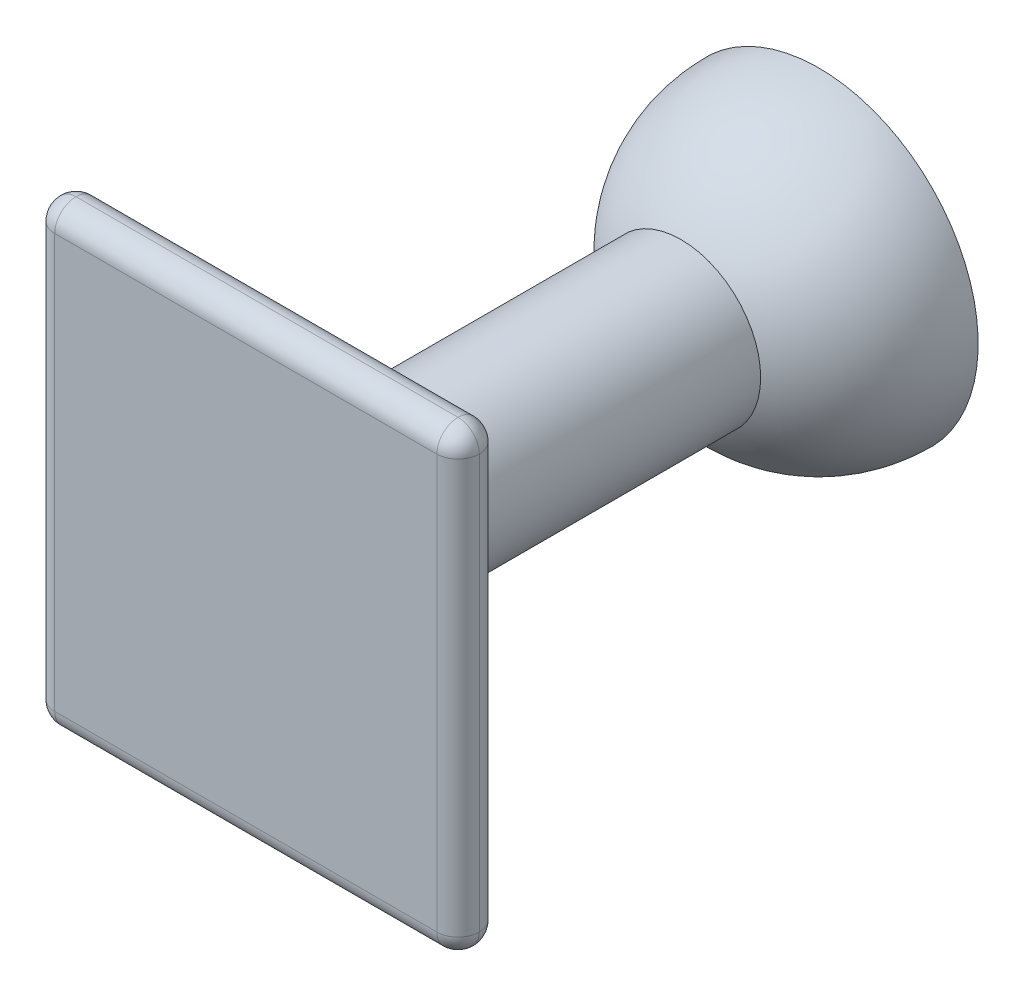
ISO-10303-21;
HEADER;
FILE_DESCRIPTION(('STEP AP214'),'2;1');
FILE_NAME('part.step','',(''),(''),'','','');
FILE_SCHEMA(('AUTOMOTIVE_DESIGN { 1 0 10303 214 1 1 1 1 }'));
ENDSEC;
DATA;
#1=APPLICATION_CONTEXT('core data for automotive mechanical design processes');
#2=APPLICATION_PROTOCOL_DEFINITION('international standard','automotive_design',2000,#1);
#3=PRODUCT_CONTEXT('',#1,'mechanical');
#4=PRODUCT('Part','Part','',(#3));
#5=PRODUCT_RELATED_PRODUCT_CATEGORY('part','',(#4));
#6=PRODUCT_DEFINITION_FORMATION('','',#4);
#7=PRODUCT_DEFINITION_CONTEXT('part definition',#1,'design');
#8=PRODUCT_DEFINITION('design','',#6,#7);
#9=PRODUCT_DEFINITION_SHAPE('','',#8);
#10=(LENGTH_UNIT() NAMED_UNIT(*) SI_UNIT(.MILLI.,.METRE.));
#11=(NAMED_UNIT(*) PLANE_ANGLE_UNIT() SI_UNIT($,.RADIAN.));
#12=(NAMED_UNIT(*) SI_UNIT($,.STERADIAN.) SOLID_ANGLE_UNIT());
#13=UNCERTAINTY_MEASURE_WITH_UNIT(LENGTH_MEASURE(1.E-05),#10,'distance_accuracy_value','');
#14=(GEOMETRIC_REPRESENTATION_CONTEXT(3) GLOBAL_UNCERTAINTY_ASSIGNED_CONTEXT((#13)) GLOBAL_UNIT_ASSIGNED_CONTEXT((#10,
#11,#12)) REPRESENTATION_CONTEXT('',''));
#15=CARTESIAN_POINT('',(0.,0.,0.));
#16=DIRECTION('',(0.,0.,1.));
#17=DIRECTION('',(1.,0.,0.));
#18=AXIS2_PLACEMENT_3D('',#15,#16,#17);
#19=CARTESIAN_POINT('',(-20.,21.5,4.));
#20=DIRECTION('',(0.,0.,-1.));
#21=DIRECTION('',(-1.,0.,0.));
#22=AXIS2_PLACEMENT_3D('',#19,#20,#21);
#23=PLANE('',#22);
#24=DIRECTION('',(0.,-1.,0.));
#25=VECTOR('',#24,1.);
#26=CARTESIAN_POINT('',(18.,21.5,4.));
#27=LINE('',#26,#25);
#28=CARTESIAN_POINT('',(18.,-19.5,4.));
#29=VERTEX_POINT('',#28);
#30=CARTESIAN_POINT('',(18.,19.5,4.));
#31=VERTEX_POINT('',#30);
#32=EDGE_CURVE('E138',#29,#31,#27,.F.);
#33=ORIENTED_EDGE('',*,*,#32,.T.);
#34=DIRECTION('',(1.,0.,0.));
#35=VECTOR('',#34,1.);
#36=CARTESIAN_POINT('',(-20.,19.5,4.));
#37=LINE('',#36,#35);
#38=CARTESIAN_POINT('',(-18.,19.5,4.));
#39=VERTEX_POINT('',#38);
#40=EDGE_CURVE('E198',#31,#39,#37,.F.);
#41=ORIENTED_EDGE('',*,*,#40,.T.);
#42=DIRECTION('',(0.,-1.,0.));
#43=VECTOR('',#42,1.);
#44=CARTESIAN_POINT('',(-18.,-21.5,4.));
#45=LINE('',#44,#43);
#46=CARTESIAN_POINT('',(-18.,-19.5,4.));
#47=VERTEX_POINT('',#46);
#48=EDGE_CURVE('E195',#39,#47,#45,.T.);
#49=ORIENTED_EDGE('',*,*,#48,.T.);
#50=DIRECTION('',(1.,0.,0.));
#51=VECTOR('',#50,1.);
#52=CARTESIAN_POINT('',(20.,-19.5,4.));
#53=LINE('',#52,#51);
#54=EDGE_CURVE('E193',#47,#29,#53,.T.);
#55=ORIENTED_EDGE('',*,*,#54,.T.);
#56=EDGE_LOOP('',(#33,#41,#49,#55));
#57=FACE_BOUND('',#56,.T.);
#58=ADVANCED_FACE('F41',(#57),#23,.F.);
#59=CARTESIAN_POINT('',(-20.,21.5,0.));
#60=DIRECTION('',(0.,0.,-1.));
#61=DIRECTION('',(-1.,0.,0.));
#62=AXIS2_PLACEMENT_3D('',#59,#60,#61);
#63=PLANE('',#62);
#64=CARTESIAN_POINT('',(0.,0.,0.));
#65=DIRECTION('',(0.,0.,-1.));
#66=DIRECTION('',(-1.,0.,0.));
#67=AXIS2_PLACEMENT_3D('',#64,#65,#66);
#68=CIRCLE('',#67,7.5);
#69=CARTESIAN_POINT('',(7.5,0.,0.));
#70=VERTEX_POINT('',#69);
#71=EDGE_CURVE('E12',#70,#70,#68,.T.);
#72=ORIENTED_EDGE('',*,*,#71,.F.);
#73=EDGE_LOOP('',(#72));
#74=FACE_BOUND('',#73,.T.);
#75=DIRECTION('',(0.,-1.,0.));
#76=VECTOR('',#75,1.);
#77=CARTESIAN_POINT('',(-18.,21.5,0.));
#78=LINE('',#77,#76);
#79=CARTESIAN_POINT('',(-18.,-19.5,0.));
#80=VERTEX_POINT('',#79);
#81=CARTESIAN_POINT('',(-18.,19.5,0.));
#82=VERTEX_POINT('',#81);
#83=EDGE_CURVE('E59',#80,#82,#78,.F.);
#84=ORIENTED_EDGE('',*,*,#83,.T.);
#85=DIRECTION('',(1.,0.,0.));
#86=VECTOR('',#85,1.);
#87=CARTESIAN_POINT('',(20.,19.5,0.));
#88=LINE('',#87,#86);
#89=CARTESIAN_POINT('',(18.,19.5,0.));
#90=VERTEX_POINT('',#89);
#91=EDGE_CURVE('E48',#82,#90,#88,.T.);
#92=ORIENTED_EDGE('',*,*,#91,.T.);
#93=DIRECTION('',(0.,-1.,0.));
#94=VECTOR('',#93,1.);
#95=CARTESIAN_POINT('',(18.,21.5,0.));
#96=LINE('',#95,#94);
#97=CARTESIAN_POINT('',(18.,-19.5,0.));
#98=VERTEX_POINT('',#97);
#99=EDGE_CURVE('E203',#90,#98,#96,.T.);
#100=ORIENTED_EDGE('',*,*,#99,.T.);
#101=DIRECTION('',(1.,0.,0.));
#102=VECTOR('',#101,1.);
#103=CARTESIAN_POINT('',(-20.,-19.5,0.));
#104=LINE('',#103,#102);
#105=EDGE_CURVE('E200',#98,#80,#104,.F.);
#106=ORIENTED_EDGE('',*,*,#105,.T.);
#107=EDGE_LOOP('',(#84,#92,#100,#106));
#108=FACE_BOUND('',#107,.T.);
#109=ADVANCED_FACE('F204',(#74,#108),#63,.T.);
#110=CARTESIAN_POINT('',(-18.,21.5,2.));
#111=DIRECTION('',(0.,-1.,0.));
#112=DIRECTION('',(0.,0.,-1.));
#113=AXIS2_PLACEMENT_3D('',#110,#111,#112);
#114=CYLINDRICAL_SURFACE('',#113,2.);
#115=DIRECTION('',(0.,-1.,0.));
#116=VECTOR('',#115,1.);
#117=CARTESIAN_POINT('',(-20.,21.5,2.));
#118=LINE('',#117,#116);
#119=CARTESIAN_POINT('',(-20.,19.5,2.));
#120=VERTEX_POINT('',#119);
#121=CARTESIAN_POINT('',(-20.,-19.5,2.));
#122=VERTEX_POINT('',#121);
#123=EDGE_CURVE('E181',#120,#122,#118,.T.);
#124=ORIENTED_EDGE('',*,*,#123,.F.);
#125=CARTESIAN_POINT('',(-18.,19.5,2.));
#126=DIRECTION('',(0.,1.,0.));
#127=DIRECTION('',(0.,0.,1.));
#128=AXIS2_PLACEMENT_3D('',#125,#126,#127);
#129=CIRCLE('',#128,2.);
#130=EDGE_CURVE('E190',#82,#120,#129,.T.);
#131=ORIENTED_EDGE('',*,*,#130,.F.);
#132=ORIENTED_EDGE('',*,*,#83,.F.);
#133=CARTESIAN_POINT('',(-18.,-19.5,2.));
#134=DIRECTION('',(0.,-1.,0.));
#135=DIRECTION('',(0.,0.,-1.));
#136=AXIS2_PLACEMENT_3D('',#133,#134,#135);
#137=CIRCLE('',#136,2.);
#138=EDGE_CURVE('E187',#122,#80,#137,.T.);
#139=ORIENTED_EDGE('',*,*,#138,.F.);
#140=EDGE_LOOP('',(#124,#131,#132,#139));
#141=FACE_BOUND('',#140,.T.);
#142=ADVANCED_FACE('F208',(#141),#114,.T.);
#143=CARTESIAN_POINT('',(-18.,19.5,2.));
#144=DIRECTION('',(0.,0.,1.));
#145=DIRECTION('',(1.,0.,0.));
#146=AXIS2_PLACEMENT_3D('',#143,#144,#145);
#147=SPHERICAL_SURFACE('',#146,2.);
#148=ORIENTED_EDGE('',*,*,#130,.T.);
#149=CARTESIAN_POINT('',(-18.,19.5,2.));
#150=DIRECTION('',(0.,0.,1.));
#151=DIRECTION('',(1.,0.,0.));
#152=AXIS2_PLACEMENT_3D('',#149,#150,#151);
#153=CIRCLE('',#152,2.);
#154=CARTESIAN_POINT('',(-18.,21.5,2.));
#155=VERTEX_POINT('',#154);
#156=EDGE_CURVE('E176',#155,#120,#153,.T.);
#157=ORIENTED_EDGE('',*,*,#156,.F.);
#158=CARTESIAN_POINT('',(-18.,19.5,2.));
#159=DIRECTION('',(-1.,0.,0.));
#160=DIRECTION('',(0.,0.,1.));
#161=AXIS2_PLACEMENT_3D('',#158,#159,#160);
#162=CIRCLE('',#161,2.);
#163=EDGE_CURVE('E173',#82,#155,#162,.F.);
#164=ORIENTED_EDGE('',*,*,#163,.F.);
#165=EDGE_LOOP('',(#148,#157,#164));
#166=FACE_BOUND('',#165,.T.);
#167=ADVANCED_FACE('F227',(#166),#147,.T.);
#168=CARTESIAN_POINT('',(-18.,-19.5,2.));
#169=DIRECTION('',(0.,0.,1.));
#170=DIRECTION('',(1.,0.,0.));
#171=AXIS2_PLACEMENT_3D('',#168,#169,#170);
#172=SPHERICAL_SURFACE('',#171,2.);
#173=CARTESIAN_POINT('',(-18.,-19.5,2.));
#174=DIRECTION('',(0.,0.,-1.));
#175=DIRECTION('',(-1.,0.,0.));
#176=AXIS2_PLACEMENT_3D('',#173,#174,#175);
#177=CIRCLE('',#176,2.);
#178=CARTESIAN_POINT('',(-18.,-21.5,2.));
#179=VERTEX_POINT('',#178);
#180=EDGE_CURVE('E184',#122,#179,#177,.F.);
#181=ORIENTED_EDGE('',*,*,#180,.F.);
#182=ORIENTED_EDGE('',*,*,#138,.T.);
#183=CARTESIAN_POINT('',(-18.,-19.5,2.));
#184=DIRECTION('',(-1.,0.,0.));
#185=DIRECTION('',(0.,-1.,0.));
#186=AXIS2_PLACEMENT_3D('',#183,#184,#185);
#187=CIRCLE('',#186,2.);
#188=EDGE_CURVE('E170',#179,#80,#187,.F.);
#189=ORIENTED_EDGE('',*,*,#188,.F.);
#190=EDGE_LOOP('',(#181,#182,#189));
#191=FACE_BOUND('',#190,.T.);
#192=ADVANCED_FACE('F212',(#191),#172,.T.);
#193=CARTESIAN_POINT('',(-18.,21.5,2.));
#194=DIRECTION('',(0.,1.,0.));
#195=DIRECTION('',(0.,0.,1.));
#196=AXIS2_PLACEMENT_3D('',#193,#194,#195);
#197=CYLINDRICAL_SURFACE('',#196,2.);
#198=CARTESIAN_POINT('',(-18.,19.5,2.));
#199=DIRECTION('',(0.,1.,0.));
#200=DIRECTION('',(0.,0.,1.));
#201=AXIS2_PLACEMENT_3D('',#198,#199,#200);
#202=CIRCLE('',#201,2.);
#203=EDGE_CURVE('E178',#120,#39,#202,.T.);
#204=ORIENTED_EDGE('',*,*,#203,.F.);
#205=ORIENTED_EDGE('',*,*,#123,.T.);
#206=CARTESIAN_POINT('',(-18.,-19.5,2.));
#207=DIRECTION('',(0.,-1.,0.));
#208=DIRECTION('',(1.,0.,0.));
#209=AXIS2_PLACEMENT_3D('',#206,#207,#208);
#210=CIRCLE('',#209,2.);
#211=EDGE_CURVE('E167',#47,#122,#210,.T.);
#212=ORIENTED_EDGE('',*,*,#211,.F.);
#213=ORIENTED_EDGE('',*,*,#48,.F.);
#214=EDGE_LOOP('',(#204,#205,#212,#213));
#215=FACE_BOUND('',#214,.T.);
#216=ADVANCED_FACE('F225',(#215),#197,.T.);
#217=CARTESIAN_POINT('',(-18.,19.5,2.));
#218=DIRECTION('',(0.,0.,1.));
#219=DIRECTION('',(1.,0.,0.));
#220=AXIS2_PLACEMENT_3D('',#217,#218,#219);
#221=SPHERICAL_SURFACE('',#220,2.);
#222=ORIENTED_EDGE('',*,*,#156,.T.);
#223=ORIENTED_EDGE('',*,*,#203,.T.);
#224=CARTESIAN_POINT('',(-18.,19.5,2.));
#225=DIRECTION('',(-1.,0.,0.));
#226=DIRECTION('',(0.,0.,1.));
#227=AXIS2_PLACEMENT_3D('',#224,#225,#226);
#228=CIRCLE('',#227,2.);
#229=EDGE_CURVE('E164',#155,#39,#228,.F.);
#230=ORIENTED_EDGE('',*,*,#229,.F.);
#231=EDGE_LOOP('',(#222,#223,#230));
#232=FACE_BOUND('',#231,.T.);
#233=ADVANCED_FACE('F257',(#232),#221,.T.);
#234=CARTESIAN_POINT('',(-20.,19.5,2.));
#235=DIRECTION('',(-1.,0.,0.));
#236=DIRECTION('',(0.,0.,1.));
#237=AXIS2_PLACEMENT_3D('',#234,#235,#236);
#238=CYLINDRICAL_SURFACE('',#237,2.);
#239=ORIENTED_EDGE('',*,*,#91,.F.);
#240=ORIENTED_EDGE('',*,*,#163,.T.);
#241=DIRECTION('',(1.,0.,0.));
#242=VECTOR('',#241,1.);
#243=CARTESIAN_POINT('',(-20.,21.5,2.));
#244=LINE('',#243,#242);
#245=CARTESIAN_POINT('',(18.,21.5,2.));
#246=VERTEX_POINT('',#245);
#247=EDGE_CURVE('E161',#246,#155,#244,.F.);
#248=ORIENTED_EDGE('',*,*,#247,.F.);
#249=CARTESIAN_POINT('',(18.,19.5,2.));
#250=DIRECTION('',(1.,0.,0.));
#251=DIRECTION('',(0.,1.,0.));
#252=AXIS2_PLACEMENT_3D('',#249,#250,#251);
#253=CIRCLE('',#252,2.);
#254=EDGE_CURVE('E158',#90,#246,#253,.T.);
#255=ORIENTED_EDGE('',*,*,#254,.F.);
#256=EDGE_LOOP('',(#239,#240,#248,#255));
#257=FACE_BOUND('',#256,.T.);
#258=ADVANCED_FACE('F230',(#257),#238,.T.);
#259=CARTESIAN_POINT('',(20.,-19.5,2.));
#260=DIRECTION('',(1.,0.,0.));
#261=DIRECTION('',(0.,0.,-1.));
#262=AXIS2_PLACEMENT_3D('',#259,#260,#261);
#263=CYLINDRICAL_SURFACE('',#262,2.);
#264=ORIENTED_EDGE('',*,*,#188,.T.);
#265=ORIENTED_EDGE('',*,*,#105,.F.);
#266=CARTESIAN_POINT('',(18.,-19.5,2.));
#267=DIRECTION('',(1.,0.,0.));
#268=DIRECTION('',(0.,0.,-1.));
#269=AXIS2_PLACEMENT_3D('',#266,#267,#268);
#270=CIRCLE('',#269,2.);
#271=CARTESIAN_POINT('',(18.,-21.5,2.));
#272=VERTEX_POINT('',#271);
#273=EDGE_CURVE('E109',#272,#98,#270,.T.);
#274=ORIENTED_EDGE('',*,*,#273,.F.);
#275=DIRECTION('',(1.,0.,0.));
#276=VECTOR('',#275,1.);
#277=CARTESIAN_POINT('',(20.,-21.5,2.));
#278=LINE('',#277,#276);
#279=EDGE_CURVE('E124',#179,#272,#278,.T.);
#280=ORIENTED_EDGE('',*,*,#279,.F.);
#281=EDGE_LOOP('',(#264,#265,#274,#280));
#282=FACE_BOUND('',#281,.T.);
#283=ADVANCED_FACE('F214',(#282),#263,.T.);
#284=CARTESIAN_POINT('',(-18.,-19.5,2.));
#285=DIRECTION('',(0.,0.,1.));
#286=DIRECTION('',(1.,0.,0.));
#287=AXIS2_PLACEMENT_3D('',#284,#285,#286);
#288=SPHERICAL_SURFACE('',#287,2.);
#289=ORIENTED_EDGE('',*,*,#211,.T.);
#290=ORIENTED_EDGE('',*,*,#180,.T.);
#291=CARTESIAN_POINT('',(-18.,-19.5,2.));
#292=DIRECTION('',(-1.,0.,0.));
#293=DIRECTION('',(0.,0.,1.));
#294=AXIS2_PLACEMENT_3D('',#291,#292,#293);
#295=CIRCLE('',#294,2.);
#296=EDGE_CURVE('E153',#47,#179,#295,.F.);
#297=ORIENTED_EDGE('',*,*,#296,.F.);
#298=EDGE_LOOP('',(#289,#290,#297));
#299=FACE_BOUND('',#298,.T.);
#300=ADVANCED_FACE('F220',(#299),#288,.T.);
#301=CARTESIAN_POINT('',(20.,19.5,2.));
#302=DIRECTION('',(1.,0.,0.));
#303=DIRECTION('',(0.,0.,-1.));
#304=AXIS2_PLACEMENT_3D('',#301,#302,#303);
#305=CYLINDRICAL_SURFACE('',#304,2.);
#306=CARTESIAN_POINT('',(18.,19.5,2.));
#307=DIRECTION('',(1.,0.,0.));
#308=DIRECTION('',(0.,0.,-1.));
#309=AXIS2_PLACEMENT_3D('',#306,#307,#308);
#310=CIRCLE('',#309,2.);
#311=EDGE_CURVE('E150',#246,#31,#310,.T.);
#312=ORIENTED_EDGE('',*,*,#311,.F.);
#313=ORIENTED_EDGE('',*,*,#247,.T.);
#314=ORIENTED_EDGE('',*,*,#229,.T.);
#315=ORIENTED_EDGE('',*,*,#40,.F.);
#316=EDGE_LOOP('',(#312,#313,#314,#315));
#317=FACE_BOUND('',#316,.T.);
#318=ADVANCED_FACE('F238',(#317),#305,.T.);
#319=CARTESIAN_POINT('',(18.,19.5,2.));
#320=DIRECTION('',(0.,0.,1.));
#321=DIRECTION('',(1.,0.,0.));
#322=AXIS2_PLACEMENT_3D('',#319,#320,#321);
#323=SPHERICAL_SURFACE('',#322,2.);
#324=ORIENTED_EDGE('',*,*,#254,.T.);
#325=CARTESIAN_POINT('',(18.,19.5,2.));
#326=DIRECTION('',(0.,0.,1.));
#327=DIRECTION('',(1.,0.,0.));
#328=AXIS2_PLACEMENT_3D('',#325,#326,#327);
#329=CIRCLE('',#328,2.);
#330=CARTESIAN_POINT('',(20.,19.5,2.));
#331=VERTEX_POINT('',#330);
#332=EDGE_CURVE('E147',#331,#246,#329,.T.);
#333=ORIENTED_EDGE('',*,*,#332,.F.);
#334=CARTESIAN_POINT('',(18.,19.5,2.));
#335=DIRECTION('',(0.,1.,0.));
#336=DIRECTION('',(0.,0.,1.));
#337=AXIS2_PLACEMENT_3D('',#334,#335,#336);
#338=CIRCLE('',#337,2.);
#339=EDGE_CURVE('E114',#90,#331,#338,.F.);
#340=ORIENTED_EDGE('',*,*,#339,.F.);
#341=EDGE_LOOP('',(#324,#333,#340));
#342=FACE_BOUND('',#341,.T.);
#343=ADVANCED_FACE('F232',(#342),#323,.T.);
#344=CARTESIAN_POINT('',(18.,-19.5,2.));
#345=DIRECTION('',(0.,0.,1.));
#346=DIRECTION('',(1.,0.,0.));
#347=AXIS2_PLACEMENT_3D('',#344,#345,#346);
#348=SPHERICAL_SURFACE('',#347,2.);
#349=CARTESIAN_POINT('',(18.,-19.5,2.));
#350=DIRECTION('',(0.,0.,-1.));
#351=DIRECTION('',(-1.,0.,0.));
#352=AXIS2_PLACEMENT_3D('',#349,#350,#351);
#353=CIRCLE('',#352,2.);
#354=CARTESIAN_POINT('',(20.,-19.5,2.));
#355=VERTEX_POINT('',#354);
#356=EDGE_CURVE('E107',#272,#355,#353,.F.);
#357=ORIENTED_EDGE('',*,*,#356,.F.);
#358=ORIENTED_EDGE('',*,*,#273,.T.);
#359=CARTESIAN_POINT('',(18.,-19.5,2.));
#360=DIRECTION('',(0.,-1.,0.));
#361=DIRECTION('',(0.,0.,-1.));
#362=AXIS2_PLACEMENT_3D('',#359,#360,#361);
#363=CIRCLE('',#362,2.);
#364=EDGE_CURVE('E104',#355,#98,#363,.F.);
#365=ORIENTED_EDGE('',*,*,#364,.F.);
#366=EDGE_LOOP('',(#357,#358,#365));
#367=FACE_BOUND('',#366,.T.);
#368=ADVANCED_FACE('F106',(#367),#348,.T.);
#369=CARTESIAN_POINT('',(-20.,-19.5,2.));
#370=DIRECTION('',(-1.,0.,0.));
#371=DIRECTION('',(0.,0.,1.));
#372=AXIS2_PLACEMENT_3D('',#369,#370,#371);
#373=CYLINDRICAL_SURFACE('',#372,2.);
#374=ORIENTED_EDGE('',*,*,#296,.T.);
#375=ORIENTED_EDGE('',*,*,#279,.T.);
#376=CARTESIAN_POINT('',(18.,-19.5,2.));
#377=DIRECTION('',(1.,0.,0.));
#378=DIRECTION('',(0.,0.,-1.));
#379=AXIS2_PLACEMENT_3D('',#376,#377,#378);
#380=CIRCLE('',#379,2.);
#381=EDGE_CURVE('E115',#29,#272,#380,.T.);
#382=ORIENTED_EDGE('',*,*,#381,.F.);
#383=ORIENTED_EDGE('',*,*,#54,.F.);
#384=EDGE_LOOP('',(#374,#375,#382,#383));
#385=FACE_BOUND('',#384,.T.);
#386=ADVANCED_FACE('F218',(#385),#373,.T.);
#387=CARTESIAN_POINT('',(18.,19.5,2.));
#388=DIRECTION('',(0.,0.,1.));
#389=DIRECTION('',(1.,0.,0.));
#390=AXIS2_PLACEMENT_3D('',#387,#388,#389);
#391=SPHERICAL_SURFACE('',#390,2.);
#392=ORIENTED_EDGE('',*,*,#332,.T.);
#393=ORIENTED_EDGE('',*,*,#311,.T.);
#394=CARTESIAN_POINT('',(18.,19.5,2.));
#395=DIRECTION('',(0.,1.,0.));
#396=DIRECTION('',(0.,0.,1.));
#397=AXIS2_PLACEMENT_3D('',#394,#395,#396);
#398=CIRCLE('',#397,2.);
#399=EDGE_CURVE('E133',#331,#31,#398,.F.);
#400=ORIENTED_EDGE('',*,*,#399,.F.);
#401=EDGE_LOOP('',(#392,#393,#400));
#402=FACE_BOUND('',#401,.T.);
#403=ADVANCED_FACE('F235',(#402),#391,.T.);
#404=CARTESIAN_POINT('',(18.,21.5,2.));
#405=DIRECTION('',(0.,-1.,0.));
#406=DIRECTION('',(0.,0.,-1.));
#407=AXIS2_PLACEMENT_3D('',#404,#405,#406);
#408=CYLINDRICAL_SURFACE('',#407,2.);
#409=ORIENTED_EDGE('',*,*,#99,.F.);
#410=ORIENTED_EDGE('',*,*,#339,.T.);
#411=DIRECTION('',(0.,-1.,0.));
#412=VECTOR('',#411,1.);
#413=CARTESIAN_POINT('',(20.,21.5,2.));
#414=LINE('',#413,#412);
#415=EDGE_CURVE('E128',#355,#331,#414,.F.);
#416=ORIENTED_EDGE('',*,*,#415,.F.);
#417=ORIENTED_EDGE('',*,*,#364,.T.);
#418=EDGE_LOOP('',(#409,#410,#416,#417));
#419=FACE_BOUND('',#418,.T.);
#420=ADVANCED_FACE('F129',(#419),#408,.T.);
#421=CARTESIAN_POINT('',(18.,-19.5,2.));
#422=DIRECTION('',(0.,0.,1.));
#423=DIRECTION('',(1.,0.,0.));
#424=AXIS2_PLACEMENT_3D('',#421,#422,#423);
#425=SPHERICAL_SURFACE('',#424,2.);
#426=ORIENTED_EDGE('',*,*,#381,.T.);
#427=ORIENTED_EDGE('',*,*,#356,.T.);
#428=CARTESIAN_POINT('',(18.,-19.5,2.));
#429=DIRECTION('',(0.,-1.,0.));
#430=DIRECTION('',(0.,0.,-1.));
#431=AXIS2_PLACEMENT_3D('',#428,#429,#430);
#432=CIRCLE('',#431,2.);
#433=EDGE_CURVE('E122',#29,#355,#432,.F.);
#434=ORIENTED_EDGE('',*,*,#433,.F.);
#435=EDGE_LOOP('',(#426,#427,#434));
#436=FACE_BOUND('',#435,.T.);
#437=ADVANCED_FACE('F120',(#436),#425,.T.);
#438=CARTESIAN_POINT('',(18.,21.5,2.));
#439=DIRECTION('',(0.,1.,0.));
#440=DIRECTION('',(0.,0.,1.));
#441=AXIS2_PLACEMENT_3D('',#438,#439,#440);
#442=CYLINDRICAL_SURFACE('',#441,2.);
#443=ORIENTED_EDGE('',*,*,#399,.T.);
#444=ORIENTED_EDGE('',*,*,#32,.F.);
#445=ORIENTED_EDGE('',*,*,#433,.T.);
#446=ORIENTED_EDGE('',*,*,#415,.T.);
#447=EDGE_LOOP('',(#443,#444,#445,#446));
#448=FACE_BOUND('',#447,.T.);
#449=ADVANCED_FACE('F136',(#448),#442,.T.);
#450=CARTESIAN_POINT('',(0.,0.,-50.));
#451=DIRECTION('',(0.,1.,0.));
#452=DIRECTION('',(1.,0.,0.));
#453=AXIS2_PLACEMENT_3D('',#450,#451,#452);
#454=SPHERICAL_SURFACE('',#453,15.);
#455=CARTESIAN_POINT('',(0.,0.,-50.));
#456=DIRECTION('',(0.,0.,-1.));
#457=DIRECTION('',(-1.,0.,0.));
#458=AXIS2_PLACEMENT_3D('',#455,#456,#457);
#459=SPHERICAL_SURFACE('',#458,15.);
#460=CARTESIAN_POINT('',(0.,0.,-37.0096189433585));
#461=DIRECTION('',(0.,0.,-1.));
#462=DIRECTION('',(-1.,0.,0.));
#463=AXIS2_PLACEMENT_3D('',#460,#461,#462);
#464=CIRCLE('',#463,7.5);
#465=CARTESIAN_POINT('',(7.5,0.,-37.0096189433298));
#466=VERTEX_POINT('',#465);
#467=EDGE_CURVE('E139',#466,#466,#464,.T.);
#468=ORIENTED_EDGE('',*,*,#467,.T.);
#469=EDGE_LOOP('',(#468));
#470=FACE_BOUND('',#469,.T.);
#471=ADVANCED_FACE('F283',(#470),#459,.F.);
#472=CARTESIAN_POINT('',(0.,0.,-500000.));
#473=DIRECTION('',(0.,0.,1.));
#474=DIRECTION('',(1.,0.,0.));
#475=AXIS2_PLACEMENT_3D('',#472,#473,#474);
#476=CYLINDRICAL_SURFACE('',#475,7.5);
#477=CARTESIAN_POINT('',(7.5,0.,-37.0096189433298));
#478=CARTESIAN_POINT('',(7.5,0.,-36.6241020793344));
#479=CARTESIAN_POINT('',(7.5,0.,-36.238585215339));
#480=CARTESIAN_POINT('',(7.5,0.,-35.4675514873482));
#481=CARTESIAN_POINT('',(7.5,0.,-35.0820346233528));
#482=CARTESIAN_POINT('',(7.5,0.,-34.3110008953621));
#483=CARTESIAN_POINT('',(7.5,0.,-33.9254840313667));
#484=CARTESIAN_POINT('',(7.5,0.,-33.1544503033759));
#485=CARTESIAN_POINT('',(7.5,0.,-32.7689334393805));
#486=CARTESIAN_POINT('',(7.5,0.,-31.9978997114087));
#487=CARTESIAN_POINT('',(7.5,0.,-31.6123828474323));
#488=CARTESIAN_POINT('',(7.5,0.,-30.8413491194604));
#489=CARTESIAN_POINT('',(7.5,0.,-30.455832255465));
#490=CARTESIAN_POINT('',(7.5,0.,-29.6847985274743));
#491=CARTESIAN_POINT('',(7.5,0.,-29.2992816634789));
#492=CARTESIAN_POINT('',(7.5,0.,-28.5282479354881));
#493=CARTESIAN_POINT('',(7.5,0.,-28.1427310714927));
#494=CARTESIAN_POINT('',(7.5,0.,-27.3716973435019));
#495=CARTESIAN_POINT('',(7.5,0.,-26.9861804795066));
#496=CARTESIAN_POINT('',(7.5,0.,-26.2151467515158));
#497=CARTESIAN_POINT('',(7.5,0.,-25.8296298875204));
#498=CARTESIAN_POINT('',(7.5,0.,-25.0585961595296));
#499=CARTESIAN_POINT('',(7.5,0.,-24.6730792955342));
#500=CARTESIAN_POINT('',(7.5,0.,-23.9020455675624));
#501=CARTESIAN_POINT('',(7.5,0.,-23.516528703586));
#502=CARTESIAN_POINT('',(7.5,0.,-22.7454949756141));
#503=CARTESIAN_POINT('',(7.5,0.,-22.3599781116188));
#504=CARTESIAN_POINT('',(7.5,0.,-21.588944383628));
#505=CARTESIAN_POINT('',(7.5,0.,-21.2034275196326));
#506=CARTESIAN_POINT('',(7.5,0.,-20.4323937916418));
#507=CARTESIAN_POINT('',(7.5,0.,-20.0468769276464));
#508=CARTESIAN_POINT('',(7.5,0.,-19.2758431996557));
#509=CARTESIAN_POINT('',(7.5,0.,-18.8903263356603));
#510=CARTESIAN_POINT('',(7.5,0.,-18.1192926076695));
#511=CARTESIAN_POINT('',(7.5,0.,-17.7337757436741));
#512=CARTESIAN_POINT('',(7.5,0.,-16.9627420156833));
#513=CARTESIAN_POINT('',(7.5,0.,-16.577225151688));
#514=CARTESIAN_POINT('',(7.5,0.,-15.8061914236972));
#515=CARTESIAN_POINT('',(7.5,0.,-15.4206745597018));
#516=CARTESIAN_POINT('',(7.5,0.,-14.649640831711));
#517=CARTESIAN_POINT('',(7.5,0.,-14.2641239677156));
#518=CARTESIAN_POINT('',(7.5,0.,-13.4930902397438));
#519=CARTESIAN_POINT('',(7.5,0.,-13.1075733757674));
#520=CARTESIAN_POINT('',(7.5,0.,-12.3365396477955));
#521=CARTESIAN_POINT('',(7.5,0.,-11.9510227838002));
#522=CARTESIAN_POINT('',(7.5,0.,-11.1799890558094));
#523=CARTESIAN_POINT('',(7.5,0.,-10.794472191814));
#524=CARTESIAN_POINT('',(7.5,0.,-10.0234384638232));
#525=CARTESIAN_POINT('',(7.5,0.,-9.63792159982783));
#526=CARTESIAN_POINT('',(7.5,0.,-8.86688787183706));
#527=CARTESIAN_POINT('',(7.5,0.,-8.48137100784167));
#528=CARTESIAN_POINT('',(7.5,0.,-7.71033727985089));
#529=CARTESIAN_POINT('',(7.5,0.,-7.32482041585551));
#530=CARTESIAN_POINT('',(7.5,0.,-6.55378668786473));
#531=CARTESIAN_POINT('',(7.5,0.,-6.16826982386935));
#532=CARTESIAN_POINT('',(7.5,0.,-5.39723609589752));
#533=CARTESIAN_POINT('',(7.5,0.,-5.01171923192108));
#534=CARTESIAN_POINT('',(7.5,0.,-4.24068550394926));
#535=CARTESIAN_POINT('',(7.5,0.,-3.85516863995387));
#536=CARTESIAN_POINT('',(7.5,0.,-3.0841349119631));
#537=CARTESIAN_POINT('',(7.5,0.,-2.69861804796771));
#538=CARTESIAN_POINT('',(7.5,0.,-1.92758431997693));
#539=CARTESIAN_POINT('',(7.5,0.,-1.54206745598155));
#540=CARTESIAN_POINT('',(7.5,0.,-0.771033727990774));
#541=CARTESIAN_POINT('',(7.5,0.,-0.385516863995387));
#542=CARTESIAN_POINT('',(7.5,0.,0.));
#543=B_SPLINE_CURVE_WITH_KNOTS('',3,(#477,#478,#479,#480,#481,#482,#483,#484,#485,#486,#487,
#488,#489,#490,#491,#492,#493,#494,#495,#496,#497,#498,#499,#500,#501,#502,#503,#504,#505,#506,
#507,#508,#509,#510,#511,#512,#513,#514,#515,#516,#517,#518,#519,#520,#521,#522,#523,#524,#525,
#526,#527,#528,#529,#530,#531,#532,#533,#534,#535,#536,#537,#538,#539,#540,#541,#542),
.UNSPECIFIED.,.F.,.F.,(4,2,2,2,2,2,2,2,2,2,2,2,2,2,2,2,2,2,2,2,2,2,2,2,2,2,2,2,2,2,2,2,4),(0.,
1.15655059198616,2.31310118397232,3.46965177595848,4.62620236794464,5.78275295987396,
6.93930355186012,8.09585414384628,9.25240473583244,10.4089553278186,11.5655059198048,
12.7220565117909,13.8786071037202,15.0351576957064,16.1917082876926,17.3482588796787,
18.5048094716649,19.661360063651,20.8179106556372,21.9744612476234,23.1310118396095,
24.2875624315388,25.444113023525,26.6006636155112,27.7572142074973,28.9137647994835,
30.0703153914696,31.2268659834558,32.3834165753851,33.5399671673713,34.6965177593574,
35.8530683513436,37.0096189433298),.UNSPECIFIED.);
#544=EDGE_CURVE('BSEAM284',#466,#70,#543,.T.);
#545=ORIENTED_EDGE('',*,*,#467,.F.);
#546=ORIENTED_EDGE('',*,*,#71,.T.);
#547=ORIENTED_EDGE('',*,*,#544,.T.);
#548=ORIENTED_EDGE('',*,*,#544,.F.);
#549=EDGE_LOOP('',(#545,#547,#546,#548));
#550=FACE_BOUND('',#549,.T.);
#551=ADVANCED_FACE('F284',(#550),#476,.T.);
#552=CLOSED_SHELL('',(#58,#109,#142,#167,#192,#216,#233,#258,#283,#300,#318,#343,#368,#386,#403,
#420,#437,#449,#471,#551));
#553=MANIFOLD_SOLID_BREP('B2',#552);
#554=CARTESIAN_POINT('',(0.,0.,-50.));
#555=DIRECTION('',(0.,1.,0.));
#556=DIRECTION('',(1.,0.,0.));
#557=AXIS2_PLACEMENT_3D('',#554,#555,#556);
#558=SPHERICAL_SURFACE('',#557,15.);
#559=CARTESIAN_POINT('',(0.,0.,-50.));
#560=DIRECTION('',(0.,0.,1.));
#561=DIRECTION('',(-1.,0.,0.));
#562=AXIS2_PLACEMENT_3D('',#559,#560,#561);
#563=SPHERICAL_SURFACE('',#562,15.);
#564=CARTESIAN_POINT('',(0.,0.,-50.));
#565=DIRECTION('',(0.,0.,1.));
#566=DIRECTION('',(-1.,0.,0.));
#567=AXIS2_PLACEMENT_3D('',#564,#565,#566);
#568=CIRCLE('',#567,15.);
#569=CARTESIAN_POINT('',(-15.,0.,-50.0000000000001));
#570=VERTEX_POINT('',#569);
#571=EDGE_CURVE('E40',#570,#570,#568,.T.);
#572=ORIENTED_EDGE('',*,*,#571,.T.);
#573=EDGE_LOOP('',(#572));
#574=FACE_BOUND('',#573,.T.);
#575=ADVANCED_FACE('F411',(#574),#563,.T.);
#576=CARTESIAN_POINT('',(0.,0.,-50.));
#577=DIRECTION('',(0.,0.,-1.));
#578=DIRECTION('',(-1.,0.,0.));
#579=AXIS2_PLACEMENT_3D('',#576,#577,#578);
#580=PLANE('',#579);
#581=ORIENTED_EDGE('',*,*,#571,.F.);
#582=EDGE_LOOP('',(#581));
#583=FACE_BOUND('',#582,.T.);
#584=ADVANCED_FACE('F419',(#583),#580,.T.);
#585=CLOSED_SHELL('',(#575,#584));
#586=MANIFOLD_SOLID_BREP('B6',#585);
#587=ADVANCED_BREP_SHAPE_REPRESENTATION('',(#18,#553,#586),#14);
#588=SHAPE_DEFINITION_REPRESENTATION(#9,#587);
ENDSEC;
END-ISO-10303-21;
